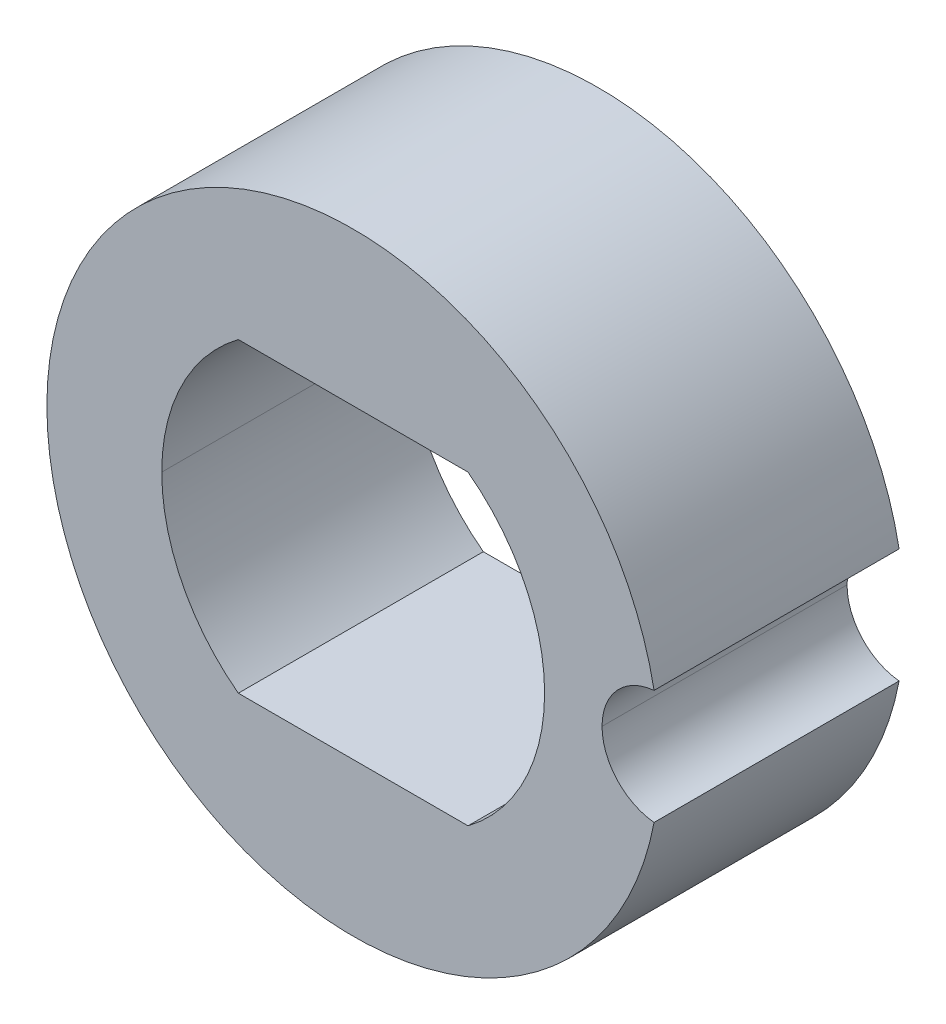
ISO-10303-21;
HEADER;
FILE_DESCRIPTION(('STEP AP214'),'2;1');
FILE_NAME('part.step','',(''),(''),'','','');
FILE_SCHEMA(('AUTOMOTIVE_DESIGN { 1 0 10303 214 1 1 1 1 }'));
ENDSEC;
DATA;
#1=APPLICATION_CONTEXT('core data for automotive mechanical design processes');
#2=APPLICATION_PROTOCOL_DEFINITION('international standard','automotive_design',2000,#1);
#3=PRODUCT_CONTEXT('',#1,'mechanical');
#4=PRODUCT('Part','Part','',(#3));
#5=PRODUCT_RELATED_PRODUCT_CATEGORY('part','',(#4));
#6=PRODUCT_DEFINITION_FORMATION('','',#4);
#7=PRODUCT_DEFINITION_CONTEXT('part definition',#1,'design');
#8=PRODUCT_DEFINITION('design','',#6,#7);
#9=PRODUCT_DEFINITION_SHAPE('','',#8);
#10=(LENGTH_UNIT() NAMED_UNIT(*) SI_UNIT(.MILLI.,.METRE.));
#11=(NAMED_UNIT(*) PLANE_ANGLE_UNIT() SI_UNIT($,.RADIAN.));
#12=(NAMED_UNIT(*) SI_UNIT($,.STERADIAN.) SOLID_ANGLE_UNIT());
#13=UNCERTAINTY_MEASURE_WITH_UNIT(LENGTH_MEASURE(1.E-05),#10,'distance_accuracy_value','');
#14=(GEOMETRIC_REPRESENTATION_CONTEXT(3) GLOBAL_UNCERTAINTY_ASSIGNED_CONTEXT((#13)) GLOBAL_UNIT_ASSIGNED_CONTEXT((#10,
#11,#12)) REPRESENTATION_CONTEXT('',''));
#15=CARTESIAN_POINT('',(0.,0.,0.));
#16=DIRECTION('',(0.,0.,1.));
#17=DIRECTION('',(1.,0.,0.));
#18=AXIS2_PLACEMENT_3D('',#15,#16,#17);
#19=CARTESIAN_POINT('',(0.,0.,10.16));
#20=DIRECTION('',(0.,0.,-1.));
#21=DIRECTION('',(-1.,0.,0.));
#22=AXIS2_PLACEMENT_3D('',#19,#20,#21);
#23=CYLINDRICAL_SURFACE('',#22,12.7);
#24=DIRECTION('',(0.,0.,1.));
#25=VECTOR('',#24,1.);
#26=CARTESIAN_POINT('',(-12.7,0.,5.08));
#27=LINE('',#26,#25);
#28=CARTESIAN_POINT('',(-12.7,0.,10.16));
#29=VERTEX_POINT('',#28);
#30=CARTESIAN_POINT('',(-12.7,-1.14037908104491E-09,0.));
#31=VERTEX_POINT('',#30);
#32=EDGE_CURVE('E88',#29,#31,#27,.F.);
#33=ORIENTED_EDGE('',*,*,#32,.T.);
#34=CARTESIAN_POINT('',(0.,0.,0.));
#35=DIRECTION('',(0.,0.,-1.));
#36=DIRECTION('',(-1.,0.,0.));
#37=AXIS2_PLACEMENT_3D('',#34,#35,#36);
#38=CIRCLE('',#37,12.7);
#39=CARTESIAN_POINT('',(12.4767578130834,-2.37076242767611,0.));
#40=VERTEX_POINT('',#39);
#41=EDGE_CURVE('E117',#31,#40,#38,.F.);
#42=ORIENTED_EDGE('',*,*,#41,.T.);
#43=DIRECTION('',(0.,0.,1.));
#44=VECTOR('',#43,1.);
#45=CARTESIAN_POINT('',(12.4767578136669,-2.37076242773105,5.08));
#46=LINE('',#45,#44);
#47=CARTESIAN_POINT('',(12.4767578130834,-2.37076242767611,10.16));
#48=VERTEX_POINT('',#47);
#49=EDGE_CURVE('E103',#48,#40,#46,.F.);
#50=ORIENTED_EDGE('',*,*,#49,.F.);
#51=CARTESIAN_POINT('',(0.,0.,10.16));
#52=DIRECTION('',(0.,0.,-1.));
#53=DIRECTION('',(-1.,0.,0.));
#54=AXIS2_PLACEMENT_3D('',#51,#52,#53);
#55=CIRCLE('',#54,12.7);
#56=EDGE_CURVE('E100',#29,#48,#55,.F.);
#57=ORIENTED_EDGE('',*,*,#56,.F.);
#58=EDGE_LOOP('',(#33,#42,#50,#57));
#59=FACE_BOUND('',#58,.T.);
#60=ADVANCED_FACE('F14',(#59),#23,.T.);
#61=CARTESIAN_POINT('',(12.7,0.,10.16));
#62=DIRECTION('',(0.,0.,-1.));
#63=DIRECTION('',(-1.,0.,0.));
#64=AXIS2_PLACEMENT_3D('',#61,#62,#63);
#65=CYLINDRICAL_SURFACE('',#64,2.38125);
#66=ORIENTED_EDGE('',*,*,#49,.T.);
#67=CARTESIAN_POINT('',(12.7,0.,0.));
#68=DIRECTION('',(0.,0.,-1.));
#69=DIRECTION('',(-1.,0.,0.));
#70=AXIS2_PLACEMENT_3D('',#67,#68,#69);
#71=CIRCLE('',#70,2.38125);
#72=CARTESIAN_POINT('',(10.31875,0.,0.));
#73=VERTEX_POINT('',#72);
#74=EDGE_CURVE('E119',#40,#73,#71,.T.);
#75=ORIENTED_EDGE('',*,*,#74,.T.);
#76=DIRECTION('',(0.,0.,1.));
#77=VECTOR('',#76,1.);
#78=CARTESIAN_POINT('',(10.31875,0.,5.08));
#79=LINE('',#78,#77);
#80=CARTESIAN_POINT('',(10.31875,-2.1382107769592E-10,10.16));
#81=VERTEX_POINT('',#80);
#82=EDGE_CURVE('E139',#81,#73,#79,.F.);
#83=ORIENTED_EDGE('',*,*,#82,.F.);
#84=CARTESIAN_POINT('',(12.7,0.,10.16));
#85=DIRECTION('',(0.,0.,-1.));
#86=DIRECTION('',(-1.,0.,0.));
#87=AXIS2_PLACEMENT_3D('',#84,#85,#86);
#88=CIRCLE('',#87,2.38125);
#89=EDGE_CURVE('E105',#48,#81,#88,.T.);
#90=ORIENTED_EDGE('',*,*,#89,.F.);
#91=EDGE_LOOP('',(#66,#75,#83,#90));
#92=FACE_BOUND('',#91,.T.);
#93=ADVANCED_FACE('F249',(#92),#65,.F.);
#94=CARTESIAN_POINT('',(12.7,0.,10.16));
#95=DIRECTION('',(0.,0.,-1.));
#96=DIRECTION('',(-1.,0.,0.));
#97=AXIS2_PLACEMENT_3D('',#94,#95,#96);
#98=CYLINDRICAL_SURFACE('',#97,2.38125);
#99=CARTESIAN_POINT('',(12.7,0.,0.));
#100=DIRECTION('',(0.,0.,-1.));
#101=DIRECTION('',(-1.,0.,0.));
#102=AXIS2_PLACEMENT_3D('',#99,#100,#101);
#103=CIRCLE('',#102,2.38125);
#104=CARTESIAN_POINT('',(12.4767578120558,2.37076242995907,0.));
#105=VERTEX_POINT('',#104);
#106=EDGE_CURVE('E122',#73,#105,#103,.T.);
#107=ORIENTED_EDGE('',*,*,#106,.T.);
#108=DIRECTION('',(0.,0.,-1.));
#109=VECTOR('',#108,1.);
#110=CARTESIAN_POINT('',(12.4767578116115,2.37076243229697,5.08));
#111=LINE('',#110,#109);
#112=CARTESIAN_POINT('',(12.4767578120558,2.37076242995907,10.16));
#113=VERTEX_POINT('',#112);
#114=EDGE_CURVE('E81',#105,#113,#111,.F.);
#115=ORIENTED_EDGE('',*,*,#114,.T.);
#116=CARTESIAN_POINT('',(12.7,0.,10.16));
#117=DIRECTION('',(0.,0.,-1.));
#118=DIRECTION('',(-1.,0.,0.));
#119=AXIS2_PLACEMENT_3D('',#116,#117,#118);
#120=CIRCLE('',#119,2.38125);
#121=EDGE_CURVE('E102',#81,#113,#120,.T.);
#122=ORIENTED_EDGE('',*,*,#121,.F.);
#123=ORIENTED_EDGE('',*,*,#82,.T.);
#124=EDGE_LOOP('',(#107,#115,#122,#123));
#125=FACE_BOUND('',#124,.T.);
#126=ADVANCED_FACE('F238',(#125),#98,.F.);
#127=CARTESIAN_POINT('',(0.,0.,10.16));
#128=DIRECTION('',(0.,0.,-1.));
#129=DIRECTION('',(-1.,0.,0.));
#130=AXIS2_PLACEMENT_3D('',#127,#128,#129);
#131=CYLINDRICAL_SURFACE('',#130,12.7);
#132=CARTESIAN_POINT('',(0.,0.,10.16));
#133=DIRECTION('',(0.,0.,-1.));
#134=DIRECTION('',(-1.,0.,0.));
#135=AXIS2_PLACEMENT_3D('',#132,#133,#134);
#136=CIRCLE('',#135,12.7);
#137=EDGE_CURVE('E18',#113,#29,#136,.F.);
#138=ORIENTED_EDGE('',*,*,#137,.F.);
#139=ORIENTED_EDGE('',*,*,#114,.F.);
#140=CARTESIAN_POINT('',(0.,0.,0.));
#141=DIRECTION('',(0.,0.,-1.));
#142=DIRECTION('',(-1.,0.,0.));
#143=AXIS2_PLACEMENT_3D('',#140,#141,#142);
#144=CIRCLE('',#143,12.7);
#145=EDGE_CURVE('E92',#105,#31,#144,.F.);
#146=ORIENTED_EDGE('',*,*,#145,.T.);
#147=ORIENTED_EDGE('',*,*,#32,.F.);
#148=EDGE_LOOP('',(#138,#139,#146,#147));
#149=FACE_BOUND('',#148,.T.);
#150=ADVANCED_FACE('F90',(#149),#131,.T.);
#151=CARTESIAN_POINT('',(-4.7625,-6.35,0.));
#152=DIRECTION('',(0.,-1.,0.));
#153=DIRECTION('',(1.,0.,0.));
#154=AXIS2_PLACEMENT_3D('',#151,#152,#153);
#155=PLANE('',#154);
#156=DIRECTION('',(-1.,0.,0.));
#157=VECTOR('',#156,1.);
#158=CARTESIAN_POINT('',(-0.1116211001,-6.3499999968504,0.));
#159=LINE('',#158,#157);
#160=CARTESIAN_POINT('',(4.76250000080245,-6.34999999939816,0.));
#161=VERTEX_POINT('',#160);
#162=CARTESIAN_POINT('',(-4.76250000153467,-6.349999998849,0.));
#163=VERTEX_POINT('',#162);
#164=EDGE_CURVE('E128',#161,#163,#159,.T.);
#165=ORIENTED_EDGE('',*,*,#164,.T.);
#166=DIRECTION('',(0.,0.,1.));
#167=VECTOR('',#166,1.);
#168=CARTESIAN_POINT('',(-4.76249999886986,-6.35000000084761,5.08));
#169=LINE('',#168,#167);
#170=CARTESIAN_POINT('',(-4.76250000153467,-6.349999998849,10.16));
#171=VERTEX_POINT('',#170);
#172=EDGE_CURVE('E116',#171,#163,#169,.F.);
#173=ORIENTED_EDGE('',*,*,#172,.F.);
#174=DIRECTION('',(-1.,0.,0.));
#175=VECTOR('',#174,1.);
#176=CARTESIAN_POINT('',(-0.1116211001,-6.3499999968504,10.16));
#177=LINE('',#176,#175);
#178=CARTESIAN_POINT('',(4.76250000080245,-6.34999999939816,10.16));
#179=VERTEX_POINT('',#178);
#180=EDGE_CURVE('E109',#179,#171,#177,.T.);
#181=ORIENTED_EDGE('',*,*,#180,.F.);
#182=DIRECTION('',(0.,0.,-1.));
#183=VECTOR('',#182,1.);
#184=CARTESIAN_POINT('',(4.76249999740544,-6.35000000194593,5.08));
#185=LINE('',#184,#183);
#186=EDGE_CURVE('E96',#161,#179,#185,.F.);
#187=ORIENTED_EDGE('',*,*,#186,.F.);
#188=EDGE_LOOP('',(#165,#173,#181,#187));
#189=FACE_BOUND('',#188,.T.);
#190=ADVANCED_FACE('F156',(#189),#155,.F.);
#191=CARTESIAN_POINT('',(0.,0.,10.16));
#192=DIRECTION('',(0.,0.,-1.));
#193=DIRECTION('',(-1.,0.,0.));
#194=AXIS2_PLACEMENT_3D('',#191,#192,#193);
#195=CYLINDRICAL_SURFACE('',#194,7.9375);
#196=ORIENTED_EDGE('',*,*,#186,.T.);
#197=CARTESIAN_POINT('',(0.,0.,10.16));
#198=DIRECTION('',(0.,0.,-1.));
#199=DIRECTION('',(-1.,0.,0.));
#200=AXIS2_PLACEMENT_3D('',#197,#198,#199);
#201=CIRCLE('',#200,7.9375);
#202=CARTESIAN_POINT('',(4.7625,6.35,10.16));
#203=VERTEX_POINT('',#202);
#204=EDGE_CURVE('E110',#203,#179,#201,.T.);
#205=ORIENTED_EDGE('',*,*,#204,.F.);
#206=DIRECTION('',(0.,0.,1.));
#207=VECTOR('',#206,1.);
#208=CARTESIAN_POINT('',(4.7625,6.35,5.08));
#209=LINE('',#208,#207);
#210=CARTESIAN_POINT('',(4.7625,6.35,0.));
#211=VERTEX_POINT('',#210);
#212=EDGE_CURVE('E136',#211,#203,#209,.T.);
#213=ORIENTED_EDGE('',*,*,#212,.F.);
#214=CARTESIAN_POINT('',(0.,0.,0.));
#215=DIRECTION('',(0.,0.,-1.));
#216=DIRECTION('',(-1.,0.,0.));
#217=AXIS2_PLACEMENT_3D('',#214,#215,#216);
#218=CIRCLE('',#217,7.9375);
#219=EDGE_CURVE('E125',#211,#161,#218,.T.);
#220=ORIENTED_EDGE('',*,*,#219,.T.);
#221=EDGE_LOOP('',(#196,#205,#213,#220));
#222=FACE_BOUND('',#221,.T.);
#223=ADVANCED_FACE('F164',(#222),#195,.F.);
#224=CARTESIAN_POINT('',(-12.8510605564,-12.8524,10.16));
#225=DIRECTION('',(0.,0.,1.));
#226=DIRECTION('',(1.,0.,0.));
#227=AXIS2_PLACEMENT_3D('',#224,#225,#226);
#228=PLANE('',#227);
#229=DIRECTION('',(-1.,0.,0.));
#230=VECTOR('',#229,1.);
#231=CARTESIAN_POINT('',(0.,6.35,10.16));
#232=LINE('',#231,#230);
#233=CARTESIAN_POINT('',(-4.76250000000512,6.34999999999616,10.16));
#234=VERTEX_POINT('',#233);
#235=EDGE_CURVE('E132',#203,#234,#232,.T.);
#236=ORIENTED_EDGE('',*,*,#235,.F.);
#237=ORIENTED_EDGE('',*,*,#204,.T.);
#238=ORIENTED_EDGE('',*,*,#180,.T.);
#239=CARTESIAN_POINT('',(0.,0.,10.16));
#240=DIRECTION('',(0.,0.,-1.));
#241=DIRECTION('',(-1.,0.,0.));
#242=AXIS2_PLACEMENT_3D('',#239,#240,#241);
#243=CIRCLE('',#242,7.9375);
#244=CARTESIAN_POINT('',(-7.9375,0.,10.16));
#245=VERTEX_POINT('',#244);
#246=EDGE_CURVE('E113',#245,#171,#243,.F.);
#247=ORIENTED_EDGE('',*,*,#246,.F.);
#248=CARTESIAN_POINT('',(0.,0.,10.16));
#249=DIRECTION('',(0.,0.,-1.));
#250=DIRECTION('',(-1.,0.,0.));
#251=AXIS2_PLACEMENT_3D('',#248,#249,#250);
#252=CIRCLE('',#251,7.9375);
#253=EDGE_CURVE('E133',#234,#245,#252,.F.);
#254=ORIENTED_EDGE('',*,*,#253,.F.);
#255=EDGE_LOOP('',(#236,#237,#238,#247,#254));
#256=FACE_BOUND('',#255,.T.);
#257=ORIENTED_EDGE('',*,*,#89,.T.);
#258=ORIENTED_EDGE('',*,*,#121,.T.);
#259=ORIENTED_EDGE('',*,*,#137,.T.);
#260=ORIENTED_EDGE('',*,*,#56,.T.);
#261=EDGE_LOOP('',(#257,#258,#259,#260));
#262=FACE_BOUND('',#261,.T.);
#263=ADVANCED_FACE('F99',(#256,#262),#228,.T.);
#264=CARTESIAN_POINT('',(0.,0.,10.16));
#265=DIRECTION('',(0.,0.,-1.));
#266=DIRECTION('',(-1.,0.,0.));
#267=AXIS2_PLACEMENT_3D('',#264,#265,#266);
#268=CYLINDRICAL_SURFACE('',#267,7.9375);
#269=ORIENTED_EDGE('',*,*,#172,.T.);
#270=CARTESIAN_POINT('',(0.,0.,0.));
#271=DIRECTION('',(0.,0.,-1.));
#272=DIRECTION('',(-1.,0.,0.));
#273=AXIS2_PLACEMENT_3D('',#270,#271,#272);
#274=CIRCLE('',#273,7.9375);
#275=CARTESIAN_POINT('',(-7.9375,-7.12736925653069E-10,0.));
#276=VERTEX_POINT('',#275);
#277=EDGE_CURVE('E129',#163,#276,#274,.T.);
#278=ORIENTED_EDGE('',*,*,#277,.T.);
#279=DIRECTION('',(0.,0.,1.));
#280=VECTOR('',#279,1.);
#281=CARTESIAN_POINT('',(-7.9375,0.,5.08));
#282=LINE('',#281,#280);
#283=EDGE_CURVE('E135',#245,#276,#282,.F.);
#284=ORIENTED_EDGE('',*,*,#283,.F.);
#285=ORIENTED_EDGE('',*,*,#246,.T.);
#286=EDGE_LOOP('',(#269,#278,#284,#285));
#287=FACE_BOUND('',#286,.T.);
#288=ADVANCED_FACE('F174',(#287),#268,.F.);
#289=CARTESIAN_POINT('',(-12.8510605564,-12.8524,0.));
#290=DIRECTION('',(0.,0.,1.));
#291=DIRECTION('',(1.,0.,0.));
#292=AXIS2_PLACEMENT_3D('',#289,#290,#291);
#293=PLANE('',#292);
#294=ORIENTED_EDGE('',*,*,#277,.F.);
#295=ORIENTED_EDGE('',*,*,#164,.F.);
#296=ORIENTED_EDGE('',*,*,#219,.F.);
#297=DIRECTION('',(1.,0.,0.));
#298=VECTOR('',#297,1.);
#299=CARTESIAN_POINT('',(0.,6.35,0.));
#300=LINE('',#299,#298);
#301=CARTESIAN_POINT('',(-4.76250000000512,6.34999999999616,0.));
#302=VERTEX_POINT('',#301);
#303=EDGE_CURVE('E146',#302,#211,#300,.T.);
#304=ORIENTED_EDGE('',*,*,#303,.F.);
#305=CARTESIAN_POINT('',(0.,0.,0.));
#306=DIRECTION('',(0.,0.,-1.));
#307=DIRECTION('',(-1.,0.,0.));
#308=AXIS2_PLACEMENT_3D('',#305,#306,#307);
#309=CIRCLE('',#308,7.9375);
#310=EDGE_CURVE('E24',#276,#302,#309,.T.);
#311=ORIENTED_EDGE('',*,*,#310,.F.);
#312=EDGE_LOOP('',(#294,#295,#296,#304,#311));
#313=FACE_BOUND('',#312,.T.);
#314=ORIENTED_EDGE('',*,*,#106,.F.);
#315=ORIENTED_EDGE('',*,*,#74,.F.);
#316=ORIENTED_EDGE('',*,*,#41,.F.);
#317=ORIENTED_EDGE('',*,*,#145,.F.);
#318=EDGE_LOOP('',(#314,#315,#316,#317));
#319=FACE_BOUND('',#318,.T.);
#320=ADVANCED_FACE('F160',(#313,#319),#293,.F.);
#321=CARTESIAN_POINT('',(-4.7625,6.35,0.));
#322=DIRECTION('',(0.,-1.,0.));
#323=DIRECTION('',(1.,0.,0.));
#324=AXIS2_PLACEMENT_3D('',#321,#322,#323);
#325=PLANE('',#324);
#326=ORIENTED_EDGE('',*,*,#303,.T.);
#327=ORIENTED_EDGE('',*,*,#212,.T.);
#328=ORIENTED_EDGE('',*,*,#235,.T.);
#329=DIRECTION('',(0.,0.,-1.));
#330=VECTOR('',#329,1.);
#331=CARTESIAN_POINT('',(-4.76250000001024,6.34999999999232,5.08));
#332=LINE('',#331,#330);
#333=EDGE_CURVE('E9',#302,#234,#332,.F.);
#334=ORIENTED_EDGE('',*,*,#333,.F.);
#335=EDGE_LOOP('',(#326,#327,#328,#334));
#336=FACE_BOUND('',#335,.T.);
#337=ADVANCED_FACE('F16',(#336),#325,.T.);
#338=CARTESIAN_POINT('',(0.,0.,10.16));
#339=DIRECTION('',(0.,0.,-1.));
#340=DIRECTION('',(-1.,0.,0.));
#341=AXIS2_PLACEMENT_3D('',#338,#339,#340);
#342=CYLINDRICAL_SURFACE('',#341,7.9375);
#343=ORIENTED_EDGE('',*,*,#310,.T.);
#344=ORIENTED_EDGE('',*,*,#333,.T.);
#345=ORIENTED_EDGE('',*,*,#253,.T.);
#346=ORIENTED_EDGE('',*,*,#283,.T.);
#347=EDGE_LOOP('',(#343,#344,#345,#346));
#348=FACE_BOUND('',#347,.T.);
#349=ADVANCED_FACE('F172',(#348),#342,.F.);
#350=CLOSED_SHELL('',(#60,#93,#126,#150,#190,#223,#263,#288,#320,#337,#349));
#351=MANIFOLD_SOLID_BREP('B1',#350);
#352=ADVANCED_BREP_SHAPE_REPRESENTATION('',(#18,#351),#14);
#353=SHAPE_DEFINITION_REPRESENTATION(#9,#352);
ENDSEC;
END-ISO-10303-21;
